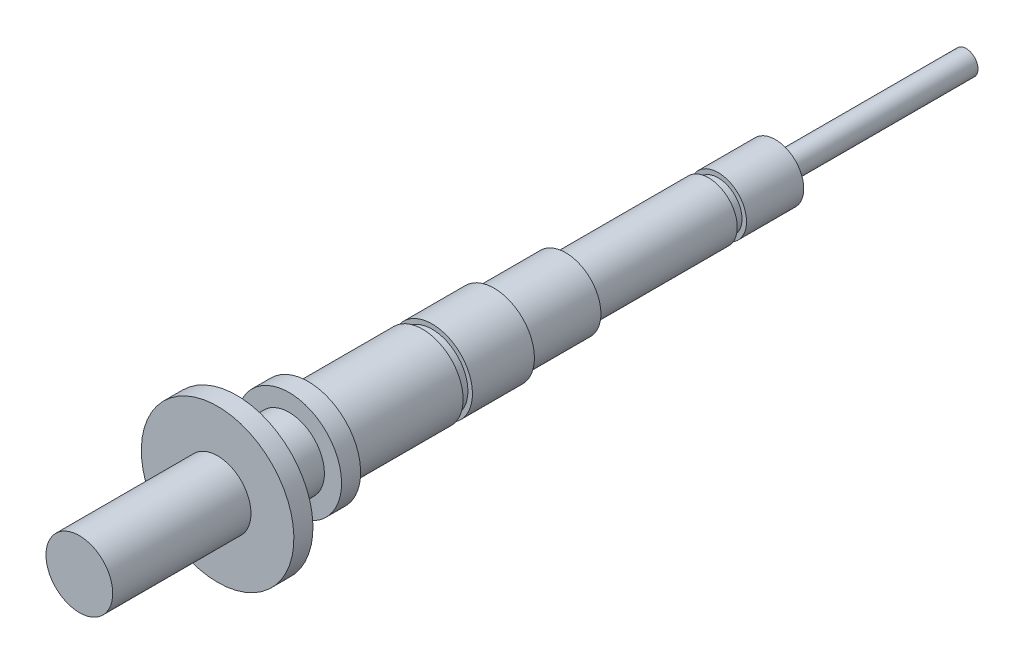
from build123d import *


with BuildPart() as part:
    # Sketch1 → Revolve2 (revolve)
    with BuildSketch(Plane(origin=(0, 0, 0), x_dir=(0, 0, -1), z_dir=(1, 0, 0)), mode=Mode.PRIVATE) as revolve2_sk:
        Polygon((-93, 0), (-93, 7), (-64, 7), (-64, 16), (-60, 16), (-60, 7.4), (-49, 7.4), (-49, 11), (-45, 11), (-45, 8.5), (-21, 8.5), (-21, 8.45), (-21, 7.5), (-19, 7.5), (-19, 8.45), (-6, 8.45), (-6, 7.4), (9, 7.4), (9, 6), (39, 6), (39, 5), (41, 5), (41, 5.95), (53, 5.95), (53, 2.5), (93, 2.5), (93, 0), align=None)
    revolve(revolve2_sk.sketch.rotate(Axis((0, 0, 126.394277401), (0, 0, -1)), 180), axis=Axis((0, 0, 126.394277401), (0, 0, -1)))


solid = part.part
